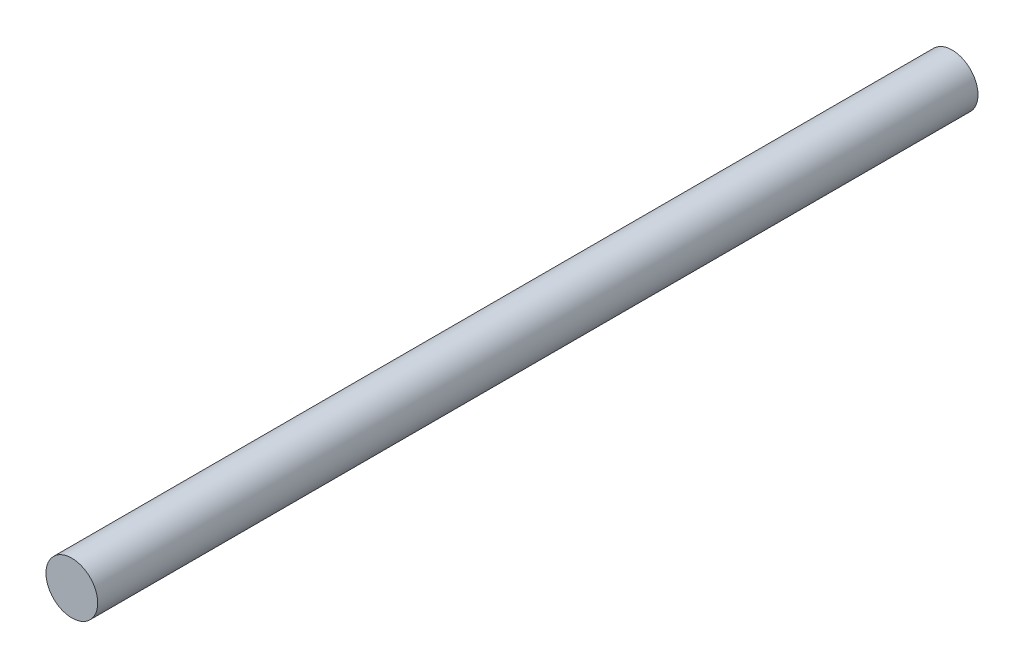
from build123d import *

# Parameters (mm, degrees)
SKETCH1_R           = 6.35
BOSS_EXTRUDE1_DEPTH = 107.95


with BuildPart() as part:
    # Sketch1 → Boss-Extrude1 (new, symmetric)
    with BuildSketch(Plane.XY):
        Circle(SKETCH1_R)
    extrude(amount=BOSS_EXTRUDE1_DEPTH, both=True)


solid = part.part
